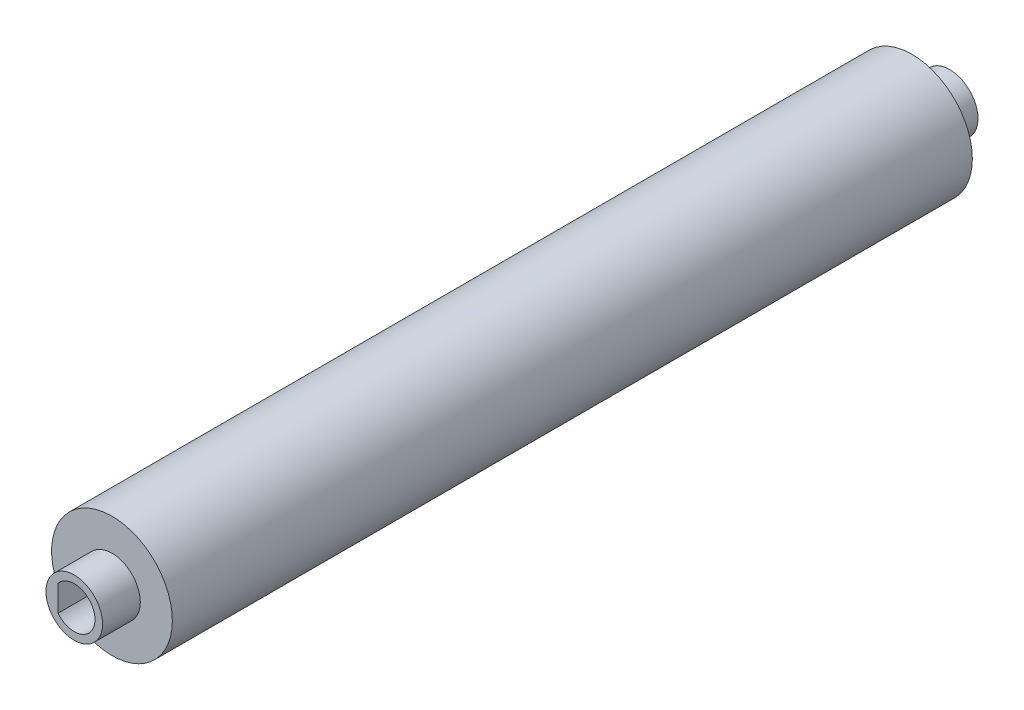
from build123d import *

# Parameters (mm, degrees)
CROQUIS1_R                   = 8
SALIENTE_EXTRUIR1_DEPTH      = 106
SALIENTE_EXTRUIR2_DEPTH      = 5
SALIENTE_EXTRUIR2_DEPTH_BACK = 111
CROQUIS2_R                   = 3.75
CORTAR_EXTRUIR2_DEPTH        = 21


with BuildPart() as part:
    # Croquis1 → Saliente-Extruir1 (new body)
    with BuildSketch(Plane.XY):
        Circle(CROQUIS1_R)
    extrude(amount=SALIENTE_EXTRUIR1_DEPTH)

    # Croquis2 → Saliente-Extruir2 (add, two sides: drawn at the far end of the back side and taken through both)
    with BuildSketch(Plane.XY.offset(106).offset(-SALIENTE_EXTRUIR2_DEPTH_BACK)):
        Circle(CROQUIS2_R)
    extrude(amount=SALIENTE_EXTRUIR2_DEPTH + SALIENTE_EXTRUIR2_DEPTH_BACK)

    # Croquis3 → Cortar-Extruir2 (cut)
    with BuildSketch(Plane.XY.offset(111)):
        with BuildLine():
            Line((-2.15, 1.71464282), (-2.15, -1.71464282))
            ThreePointArc((-2.15, -1.71464282), (2.75, 0), (-2.15, 1.71464282))
        make_face()
    extrude(amount=-CORTAR_EXTRUIR2_DEPTH, mode=Mode.SUBTRACT)


solid = part.part
